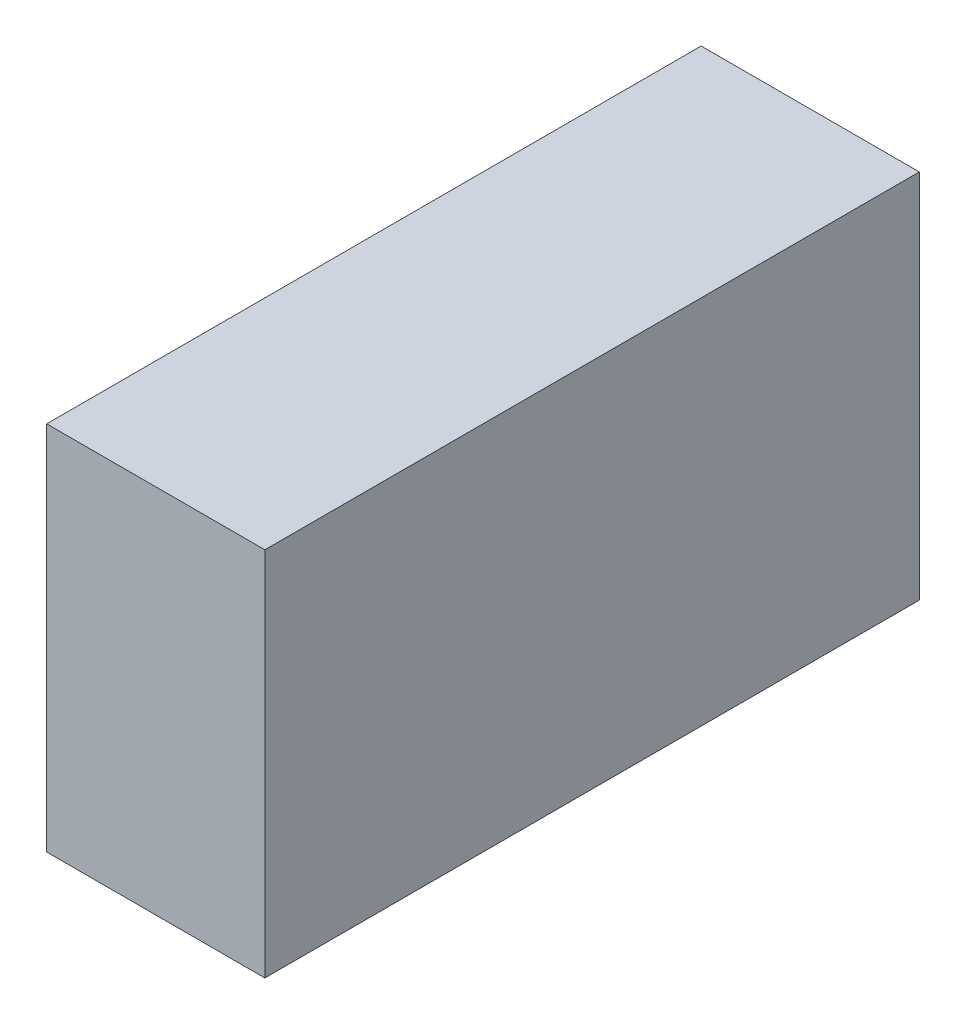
from build123d import *

# Parameters (mm, degrees)
ESQUISSE1_W      = 100
ESQUISSE1_H      = 300
EXTRUSION1_DEPTH = 170


with BuildPart() as part:
    # Esquisse1 → Extrusion1 (new body)
    with BuildSketch(Plane(origin=(0, 0, 0), x_dir=(1, 0, 0), z_dir=(0, 1, 0))):
        with Locations((50, 150)):
            Rectangle(ESQUISSE1_W, ESQUISSE1_H)
    extrude(amount=EXTRUSION1_DEPTH)


solid = part.part
